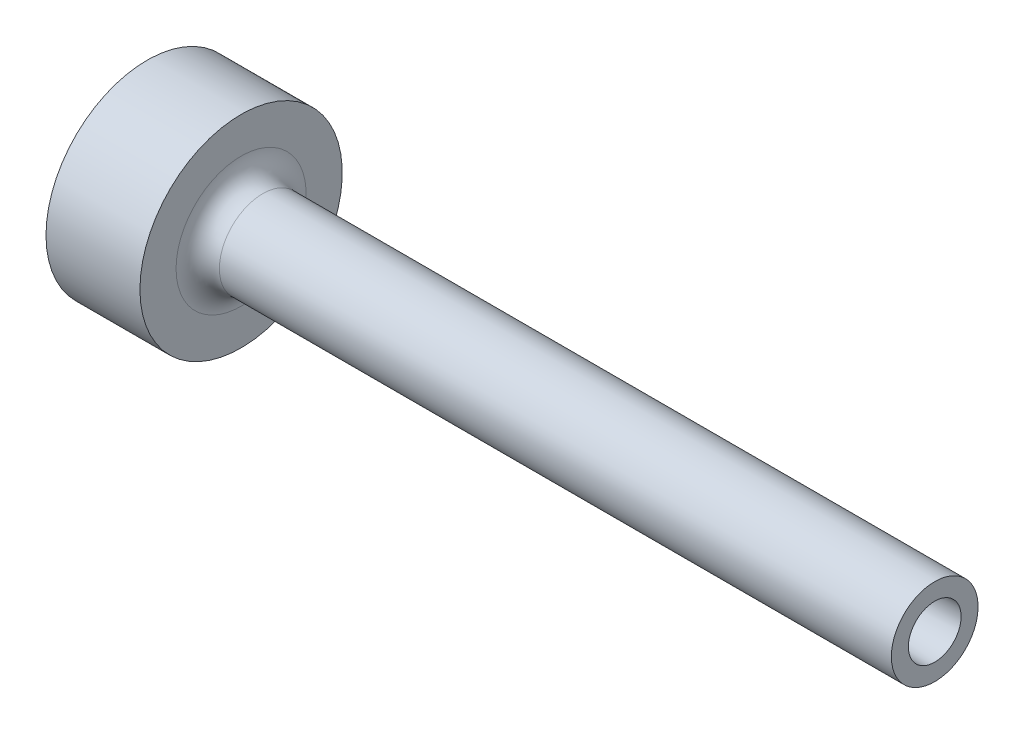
ISO-10303-21;
HEADER;
FILE_DESCRIPTION(('STEP AP214'),'2;1');
FILE_NAME('part.step','',(''),(''),'','','');
FILE_SCHEMA(('AUTOMOTIVE_DESIGN { 1 0 10303 214 1 1 1 1 }'));
ENDSEC;
DATA;
#1=APPLICATION_CONTEXT('core data for automotive mechanical design processes');
#2=APPLICATION_PROTOCOL_DEFINITION('international standard','automotive_design',2000,#1);
#3=PRODUCT_CONTEXT('',#1,'mechanical');
#4=PRODUCT('Part','Part','',(#3));
#5=PRODUCT_RELATED_PRODUCT_CATEGORY('part','',(#4));
#6=PRODUCT_DEFINITION_FORMATION('','',#4);
#7=PRODUCT_DEFINITION_CONTEXT('part definition',#1,'design');
#8=PRODUCT_DEFINITION('design','',#6,#7);
#9=PRODUCT_DEFINITION_SHAPE('','',#8);
#10=(LENGTH_UNIT() NAMED_UNIT(*) SI_UNIT(.MILLI.,.METRE.));
#11=(NAMED_UNIT(*) PLANE_ANGLE_UNIT() SI_UNIT($,.RADIAN.));
#12=(NAMED_UNIT(*) SI_UNIT($,.STERADIAN.) SOLID_ANGLE_UNIT());
#13=UNCERTAINTY_MEASURE_WITH_UNIT(LENGTH_MEASURE(1.E-05),#10,'distance_accuracy_value','');
#14=(GEOMETRIC_REPRESENTATION_CONTEXT(3) GLOBAL_UNCERTAINTY_ASSIGNED_CONTEXT((#13)) GLOBAL_UNIT_ASSIGNED_CONTEXT((#10,
#11,#12)) REPRESENTATION_CONTEXT('',''));
#15=CARTESIAN_POINT('',(0.,0.,0.));
#16=DIRECTION('',(0.,0.,1.));
#17=DIRECTION('',(1.,0.,0.));
#18=AXIS2_PLACEMENT_3D('',#15,#16,#17);
#19=CARTESIAN_POINT('',(0.,0.,0.));
#20=DIRECTION('',(-1.,0.,0.));
#21=DIRECTION('',(0.,0.,1.));
#22=AXIS2_PLACEMENT_3D('',#19,#20,#21);
#23=CYLINDRICAL_SURFACE('',#22,14.);
#24=CARTESIAN_POINT('',(13.,0.,0.));
#25=DIRECTION('',(-1.,0.,0.));
#26=DIRECTION('',(0.,0.,1.));
#27=AXIS2_PLACEMENT_3D('',#24,#25,#26);
#28=CIRCLE('',#27,14.);
#29=CARTESIAN_POINT('',(13.,0.,14.));
#30=VERTEX_POINT('',#29);
#31=EDGE_CURVE('E89',#30,#30,#28,.T.);
#32=ORIENTED_EDGE('',*,*,#31,.T.);
#33=EDGE_LOOP('',(#32));
#34=FACE_BOUND('',#33,.T.);
#35=CARTESIAN_POINT('',(0.,0.,0.));
#36=DIRECTION('',(-1.,0.,0.));
#37=DIRECTION('',(0.,0.,1.));
#38=AXIS2_PLACEMENT_3D('',#35,#36,#37);
#39=CIRCLE('',#38,14.);
#40=CARTESIAN_POINT('',(0.,0.,14.));
#41=VERTEX_POINT('',#40);
#42=EDGE_CURVE('E84',#41,#41,#39,.T.);
#43=ORIENTED_EDGE('',*,*,#42,.F.);
#44=EDGE_LOOP('',(#43));
#45=FACE_BOUND('',#44,.T.);
#46=CARTESIAN_POINT('',(6.5,-13.856406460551,-2.));
#47=CARTESIAN_POINT('',(6.61172417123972,-13.8564082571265,-1.99999534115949));
#48=CARTESIAN_POINT('',(6.72351471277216,-13.8577723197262,-1.99060664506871));
#49=CARTESIAN_POINT('',(6.9439746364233,-13.8630779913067,-1.95330740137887));
#50=CARTESIAN_POINT('',(7.05264079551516,-13.8670221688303,-1.92537839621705));
#51=CARTESIAN_POINT('',(7.26362870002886,-13.8770324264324,-1.85184738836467));
#52=CARTESIAN_POINT('',(7.36595507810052,-13.8830969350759,-1.80625847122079));
#53=CARTESIAN_POINT('',(7.56148972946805,-13.8966626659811,-1.69873175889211));
#54=CARTESIAN_POINT('',(7.65469934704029,-13.9041636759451,-1.63679637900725));
#55=CARTESIAN_POINT('',(7.83004829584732,-13.9198182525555,-1.49785346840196));
#56=CARTESIAN_POINT('',(7.91211171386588,-13.9279757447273,-1.42075056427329));
#57=CARTESIAN_POINT('',(8.06218155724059,-13.9439890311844,-1.25386707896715));
#58=CARTESIAN_POINT('',(8.13018723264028,-13.9518448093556,-1.16408582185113));
#59=CARTESIAN_POINT('',(8.25048909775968,-13.9664103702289,-0.973910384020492));
#60=CARTESIAN_POINT('',(8.30271571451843,-13.9731150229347,-0.873471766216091));
#61=CARTESIAN_POINT('',(8.38953073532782,-13.9845795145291,-0.665136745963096));
#62=CARTESIAN_POINT('',(8.4241199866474,-13.9893394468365,-0.557240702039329));
#63=CARTESIAN_POINT('',(8.47444920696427,-13.9963505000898,-0.337834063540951));
#64=CARTESIAN_POINT('',(8.49031606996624,-13.9986185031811,-0.226353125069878));
#65=CARTESIAN_POINT('',(8.5031438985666,-14.0004479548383,-0.00228956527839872));
#66=CARTESIAN_POINT('',(8.50010582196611,-14.0000095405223,0.110292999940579));
#67=CARTESIAN_POINT('',(8.47531062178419,-13.9964890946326,0.33249899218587));
#68=CARTESIAN_POINT('',(8.45369000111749,-13.9934263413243,0.442137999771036));
#69=CARTESIAN_POINT('',(8.39255744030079,-13.9850228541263,0.656215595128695));
#70=CARTESIAN_POINT('',(8.3530450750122,-13.9796820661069,0.760654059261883));
#71=CARTESIAN_POINT('',(8.25710925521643,-13.9672894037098,0.961781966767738));
#72=CARTESIAN_POINT('',(8.20062784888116,-13.9602316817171,1.05844339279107));
#73=CARTESIAN_POINT('',(8.07239950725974,-13.9451926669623,1.24096782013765));
#74=CARTESIAN_POINT('',(8.00065165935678,-13.9372113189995,1.32683017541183));
#75=CARTESIAN_POINT('',(7.843165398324,-13.921132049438,1.48612299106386));
#76=CARTESIAN_POINT('',(7.75730786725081,-13.9130337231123,1.55943569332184));
#77=CARTESIAN_POINT('',(7.57444547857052,-13.8977029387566,1.69062989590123));
#78=CARTESIAN_POINT('',(7.47744056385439,-13.890470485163,1.74851131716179));
#79=CARTESIAN_POINT('',(7.27491971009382,-13.8776905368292,1.84721301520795));
#80=CARTESIAN_POINT('',(7.1693981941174,-13.8721441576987,1.88802200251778));
#81=CARTESIAN_POINT('',(6.95290242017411,-13.8633846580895,1.9513062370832));
#82=CARTESIAN_POINT('',(6.84192850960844,-13.8601713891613,1.97378265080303));
#83=CARTESIAN_POINT('',(6.61872346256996,-13.8564698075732,1.99960390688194));
#84=CARTESIAN_POINT('',(6.50651197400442,-13.8559577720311,2.00311531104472));
#85=CARTESIAN_POINT('',(6.28310219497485,-13.8576537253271,1.9913480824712));
#86=CARTESIAN_POINT('',(6.17190387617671,-13.8598616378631,1.9760699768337));
#87=CARTESIAN_POINT('',(5.95418781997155,-13.8667269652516,1.92729837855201));
#88=CARTESIAN_POINT('',(5.84765127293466,-13.8713733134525,1.8938871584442));
#89=CARTESIAN_POINT('',(5.6416912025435,-13.8825829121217,1.80988306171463));
#90=CARTESIAN_POINT('',(5.54226800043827,-13.8891462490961,1.75928940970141));
#91=CARTESIAN_POINT('',(5.35260812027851,-13.9035064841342,1.64195360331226));
#92=CARTESIAN_POINT('',(5.26243903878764,-13.911311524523,1.57510320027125));
#93=CARTESIAN_POINT('',(5.09454027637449,-13.9272509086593,1.42730277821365));
#94=CARTESIAN_POINT('',(5.01681123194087,-13.9353852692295,1.34635203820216));
#95=CARTESIAN_POINT('',(4.8754047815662,-13.9511405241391,1.17191708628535));
#96=CARTESIAN_POINT('',(4.81183747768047,-13.9587570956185,1.07834317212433));
#97=CARTESIAN_POINT('',(4.70132443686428,-13.972552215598,0.881748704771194));
#98=CARTESIAN_POINT('',(4.65437828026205,-13.9787308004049,0.778728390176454));
#99=CARTESIAN_POINT('',(4.57861788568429,-13.9889347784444,0.566515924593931));
#100=CARTESIAN_POINT('',(4.54974241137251,-13.9929674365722,0.457345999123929));
#101=CARTESIAN_POINT('',(4.51074453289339,-13.9984555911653,0.235645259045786));
#102=CARTESIAN_POINT('',(4.50062101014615,-13.9999112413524,0.123114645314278));
#103=CARTESIAN_POINT('',(4.49943976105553,-14.0000800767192,-0.101043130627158));
#104=CARTESIAN_POINT('',(4.50821318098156,-13.998817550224,-0.212669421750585));
#105=CARTESIAN_POINT('',(4.54421615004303,-13.9937406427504,-0.432842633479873));
#106=CARTESIAN_POINT('',(4.57144565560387,-13.989926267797,-0.541389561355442));
#107=CARTESIAN_POINT('',(4.6435299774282,-13.9801722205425,-0.752283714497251));
#108=CARTESIAN_POINT('',(4.68837418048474,-13.9742338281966,-0.854634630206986));
#109=CARTESIAN_POINT('',(4.79439714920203,-13.960885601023,-1.05038570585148));
#110=CARTESIAN_POINT('',(4.8555763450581,-13.9534757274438,-1.14378562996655));
#111=CARTESIAN_POINT('',(4.99314771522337,-13.9379304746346,-1.31984194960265));
#112=CARTESIAN_POINT('',(5.06966490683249,-13.9297894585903,-1.40240016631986));
#113=CARTESIAN_POINT('',(5.2354775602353,-13.9137422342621,-1.55356716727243));
#114=CARTESIAN_POINT('',(5.32477602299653,-13.9058360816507,-1.6221726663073));
#115=CARTESIAN_POINT('',(5.51414543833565,-13.8911108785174,-1.74379523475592));
#116=CARTESIAN_POINT('',(5.61426869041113,-13.8842975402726,-1.79673154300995));
#117=CARTESIAN_POINT('',(5.82203229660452,-13.8725962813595,-1.88495902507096));
#118=CARTESIAN_POINT('',(5.92966459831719,-13.8677063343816,-1.92026877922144));
#119=CARTESIAN_POINT('',(6.11483642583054,-13.8615529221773,-1.96409255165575));
#120=CARTESIAN_POINT('',(6.19122433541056,-13.859633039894,-1.97753762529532));
#121=CARTESIAN_POINT('',(6.34506419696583,-13.857059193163,-1.99549291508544));
#122=CARTESIAN_POINT('',(6.42251613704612,-13.8564052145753,-2.00000323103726));
#123=CARTESIAN_POINT('',(6.5,-13.856406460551,-2.));
#124=B_SPLINE_CURVE_WITH_KNOTS('',3,(#46,#47,#48,#49,#50,#51,#52,#53,#54,#55,#56,#57,#58,#59,
#60,#61,#62,#63,#64,#65,#66,#67,#68,#69,#70,#71,#72,#73,#74,#75,#76,#77,#78,#79,#80,#81,#82,#83,
#84,#85,#86,#87,#88,#89,#90,#91,#92,#93,#94,#95,#96,#97,#98,#99,#100,#101,#102,#103,#104,#105,
#106,#107,#108,#109,#110,#111,#112,#113,#114,#115,#116,#117,#118,#119,#120,#121,#122,#123),
.UNSPECIFIED.,.T.,.F.,(4,2,2,2,2,2,2,2,2,2,2,2,2,2,2,2,2,2,2,2,2,2,2,2,2,2,2,2,2,2,2,2,2,2,2,2,
2,2,4),(0.,0.334889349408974,0.670112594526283,1.00508792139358,1.34001378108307,
1.6771171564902,2.01423851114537,2.35282530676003,2.6913958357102,3.02765822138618,
3.36390357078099,3.69769984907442,4.03150405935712,4.36646147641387,4.70143892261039,
5.03940517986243,5.37737316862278,5.7155642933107,6.05373389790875,6.3889286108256,
6.72411392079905,7.05779100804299,7.39148315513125,7.72746121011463,8.06345644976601,
8.40197921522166,8.74049343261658,9.07785422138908,9.41519488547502,9.74953375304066,
10.083871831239,10.4180087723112,10.7521545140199,11.0891434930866,11.426211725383,
11.7649881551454,12.103406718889,12.3356645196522,12.5679197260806),.UNSPECIFIED.);
#125=CARTESIAN_POINT('',(6.5,-13.856406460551,-2.));
#126=VERTEX_POINT('',#125);
#127=EDGE_CURVE('E10',#126,#126,#124,.T.);
#128=ORIENTED_EDGE('',*,*,#127,.F.);
#129=EDGE_LOOP('',(#128));
#130=FACE_BOUND('',#129,.T.);
#131=ADVANCED_FACE('F16',(#34,#45,#130),#23,.T.);
#132=CARTESIAN_POINT('',(0.,0.,0.));
#133=DIRECTION('',(1.,0.,0.));
#134=DIRECTION('',(0.,0.,-1.));
#135=AXIS2_PLACEMENT_3D('',#132,#133,#134);
#136=CONICAL_SURFACE('',#135,1.75,0.0174532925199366);
#137=CARTESIAN_POINT('',(109.,0.,0.));
#138=DIRECTION('',(-1.,0.,0.));
#139=DIRECTION('',(0.,0.,1.));
#140=AXIS2_PLACEMENT_3D('',#137,#138,#139);
#141=CIRCLE('',#140,3.65260207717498);
#142=CARTESIAN_POINT('',(109.,0.,3.65260207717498));
#143=VERTEX_POINT('',#142);
#144=EDGE_CURVE('E81',#143,#143,#141,.T.);
#145=ORIENTED_EDGE('',*,*,#144,.F.);
#146=EDGE_LOOP('',(#145));
#147=FACE_BOUND('',#146,.T.);
#148=CARTESIAN_POINT('',(0.8568945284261,0.,0.));
#149=DIRECTION('',(-1.,0.,0.));
#150=DIRECTION('',(0.,0.,1.));
#151=AXIS2_PLACEMENT_3D('',#148,#149,#150);
#152=CIRCLE('',#151,1.76495714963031);
#153=CARTESIAN_POINT('',(0.8568945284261,0.,1.76495714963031));
#154=VERTEX_POINT('',#153);
#155=EDGE_CURVE('E94',#154,#154,#152,.F.);
#156=ORIENTED_EDGE('',*,*,#155,.F.);
#157=EDGE_LOOP('',(#156));
#158=FACE_BOUND('',#157,.T.);
#159=ADVANCED_FACE('F45',(#147,#158),#136,.F.);
#160=CARTESIAN_POINT('',(16.,0.,0.));
#161=DIRECTION('',(-1.,0.,0.));
#162=DIRECTION('',(0.,0.,1.));
#163=AXIS2_PLACEMENT_3D('',#160,#161,#162);
#164=TOROIDAL_SURFACE('',#163,9.,3.);
#165=CARTESIAN_POINT('',(13.,0.,0.));
#166=DIRECTION('',(-1.,0.,0.));
#167=DIRECTION('',(0.,0.,1.));
#168=AXIS2_PLACEMENT_3D('',#165,#166,#167);
#169=CIRCLE('',#168,9.);
#170=CARTESIAN_POINT('',(13.,0.,9.));
#171=VERTEX_POINT('',#170);
#172=EDGE_CURVE('E91',#171,#171,#169,.T.);
#173=ORIENTED_EDGE('',*,*,#172,.F.);
#174=EDGE_LOOP('',(#173));
#175=FACE_BOUND('',#174,.T.);
#176=CARTESIAN_POINT('',(16.,0.,0.));
#177=DIRECTION('',(-1.,0.,0.));
#178=DIRECTION('',(0.,0.,1.));
#179=AXIS2_PLACEMENT_3D('',#176,#177,#178);
#180=CIRCLE('',#179,6.);
#181=CARTESIAN_POINT('',(16.,0.,6.));
#182=VERTEX_POINT('',#181);
#183=EDGE_CURVE('E28',#182,#182,#180,.T.);
#184=ORIENTED_EDGE('',*,*,#183,.T.);
#185=EDGE_LOOP('',(#184));
#186=FACE_BOUND('',#185,.T.);
#187=ADVANCED_FACE('F18',(#175,#186),#164,.F.);
#188=CARTESIAN_POINT('',(0.,0.,0.));
#189=DIRECTION('',(-1.,0.,0.));
#190=DIRECTION('',(0.,0.,1.));
#191=AXIS2_PLACEMENT_3D('',#188,#189,#190);
#192=CYLINDRICAL_SURFACE('',#191,6.);
#193=ORIENTED_EDGE('',*,*,#183,.F.);
#194=EDGE_LOOP('',(#193));
#195=FACE_BOUND('',#194,.T.);
#196=CARTESIAN_POINT('',(109.,0.,0.));
#197=DIRECTION('',(-1.,0.,0.));
#198=DIRECTION('',(0.,0.,1.));
#199=AXIS2_PLACEMENT_3D('',#196,#197,#198);
#200=CIRCLE('',#199,6.);
#201=CARTESIAN_POINT('',(109.,0.,6.));
#202=VERTEX_POINT('',#201);
#203=EDGE_CURVE('E80',#202,#202,#200,.T.);
#204=ORIENTED_EDGE('',*,*,#203,.T.);
#205=EDGE_LOOP('',(#204));
#206=FACE_BOUND('',#205,.T.);
#207=ADVANCED_FACE('F66',(#195,#206),#192,.T.);
#208=CARTESIAN_POINT('',(109.,6.,0.));
#209=DIRECTION('',(-1.,0.,0.));
#210=DIRECTION('',(0.,0.,1.));
#211=AXIS2_PLACEMENT_3D('',#208,#209,#210);
#212=PLANE('',#211);
#213=ORIENTED_EDGE('',*,*,#203,.F.);
#214=EDGE_LOOP('',(#213));
#215=FACE_BOUND('',#214,.T.);
#216=ORIENTED_EDGE('',*,*,#144,.T.);
#217=EDGE_LOOP('',(#216));
#218=FACE_BOUND('',#217,.T.);
#219=ADVANCED_FACE('F62',(#215,#218),#212,.F.);
#220=CARTESIAN_POINT('',(0.,1.75,0.));
#221=DIRECTION('',(1.,0.,0.));
#222=DIRECTION('',(0.,0.,-1.));
#223=AXIS2_PLACEMENT_3D('',#220,#221,#222);
#224=PLANE('',#223);
#225=CARTESIAN_POINT('',(0.,0.,0.));
#226=DIRECTION('',(-1.,0.,0.));
#227=DIRECTION('',(0.,0.,1.));
#228=AXIS2_PLACEMENT_3D('',#225,#226,#227);
#229=CIRCLE('',#228,5.);
#230=CARTESIAN_POINT('',(0.,0.,5.));
#231=VERTEX_POINT('',#230);
#232=EDGE_CURVE('E97',#231,#231,#229,.T.);
#233=ORIENTED_EDGE('',*,*,#232,.F.);
#234=EDGE_LOOP('',(#233));
#235=FACE_BOUND('',#234,.T.);
#236=ORIENTED_EDGE('',*,*,#42,.T.);
#237=EDGE_LOOP('',(#236));
#238=FACE_BOUND('',#237,.T.);
#239=ADVANCED_FACE('F60',(#235,#238),#224,.F.);
#240=CARTESIAN_POINT('',(13.,14.,0.));
#241=DIRECTION('',(-1.,0.,0.));
#242=DIRECTION('',(0.,0.,1.));
#243=AXIS2_PLACEMENT_3D('',#240,#241,#242);
#244=PLANE('',#243);
#245=ORIENTED_EDGE('',*,*,#31,.F.);
#246=EDGE_LOOP('',(#245));
#247=FACE_BOUND('',#246,.T.);
#248=ORIENTED_EDGE('',*,*,#172,.T.);
#249=EDGE_LOOP('',(#248));
#250=FACE_BOUND('',#249,.T.);
#251=ADVANCED_FACE('F58',(#247,#250),#244,.F.);
#252=CARTESIAN_POINT('',(-14.4672767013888,0.,0.));
#253=DIRECTION('',(-1.,0.,0.));
#254=DIRECTION('',(0.,0.,1.));
#255=AXIS2_PLACEMENT_3D('',#252,#253,#254);
#256=DEGENERATE_TOROIDAL_SURFACE('',#255,0.56308411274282,15.5,.F.);
#257=ORIENTED_EDGE('',*,*,#232,.T.);
#258=EDGE_LOOP('',(#257));
#259=FACE_BOUND('',#258,.T.);
#260=ORIENTED_EDGE('',*,*,#155,.T.);
#261=EDGE_LOOP('',(#260));
#262=FACE_BOUND('',#261,.T.);
#263=ADVANCED_FACE('F41',(#259,#262),#256,.T.);
#264=CARTESIAN_POINT('',(6.5,-14.,0.));
#265=DIRECTION('',(0.,-1.,0.));
#266=DIRECTION('',(0.,0.,-1.));
#267=AXIS2_PLACEMENT_3D('',#264,#265,#266);
#268=CYLINDRICAL_SURFACE('',#267,2.);
#269=CARTESIAN_POINT('',(6.5,-8.,0.));
#270=DIRECTION('',(0.,-1.,0.));
#271=DIRECTION('',(0.,0.,-1.));
#272=AXIS2_PLACEMENT_3D('',#269,#270,#271);
#273=CIRCLE('',#272,2.);
#274=CARTESIAN_POINT('',(6.5,-8.,-2.));
#275=VERTEX_POINT('',#274);
#276=EDGE_CURVE('E100',#275,#275,#273,.T.);
#277=ORIENTED_EDGE('',*,*,#276,.F.);
#278=EDGE_LOOP('',(#277));
#279=FACE_BOUND('',#278,.T.);
#280=ORIENTED_EDGE('',*,*,#127,.T.);
#281=EDGE_LOOP('',(#280));
#282=FACE_BOUND('',#281,.T.);
#283=ADVANCED_FACE('F33',(#279,#282),#268,.F.);
#284=CARTESIAN_POINT('',(6.5,-6.84529946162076,0.));
#285=DIRECTION('',(0.,-1.,0.));
#286=DIRECTION('',(0.,0.,-1.));
#287=AXIS2_PLACEMENT_3D('',#284,#285,#286);
#288=CONICAL_SURFACE('',#287,0.,1.0471975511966);
#289=ORIENTED_EDGE('',*,*,#276,.T.);
#290=EDGE_LOOP('',(#289));
#291=FACE_BOUND('',#290,.T.);
#292=CARTESIAN_POINT('',(6.5,-6.84529946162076,0.));
#293=VERTEX_POINT('',#292);
#294=VERTEX_LOOP('',#293);
#295=FACE_BOUND('',#294,.T.);
#296=ADVANCED_FACE('F31',(#291,#295),#288,.F.);
#297=CLOSED_SHELL('',(#131,#159,#187,#207,#219,#239,#251,#263,#283,#296));
#298=MANIFOLD_SOLID_BREP('B1',#297);
#299=ADVANCED_BREP_SHAPE_REPRESENTATION('',(#18,#298),#14);
#300=SHAPE_DEFINITION_REPRESENTATION(#9,#299);
ENDSEC;
END-ISO-10303-21;
